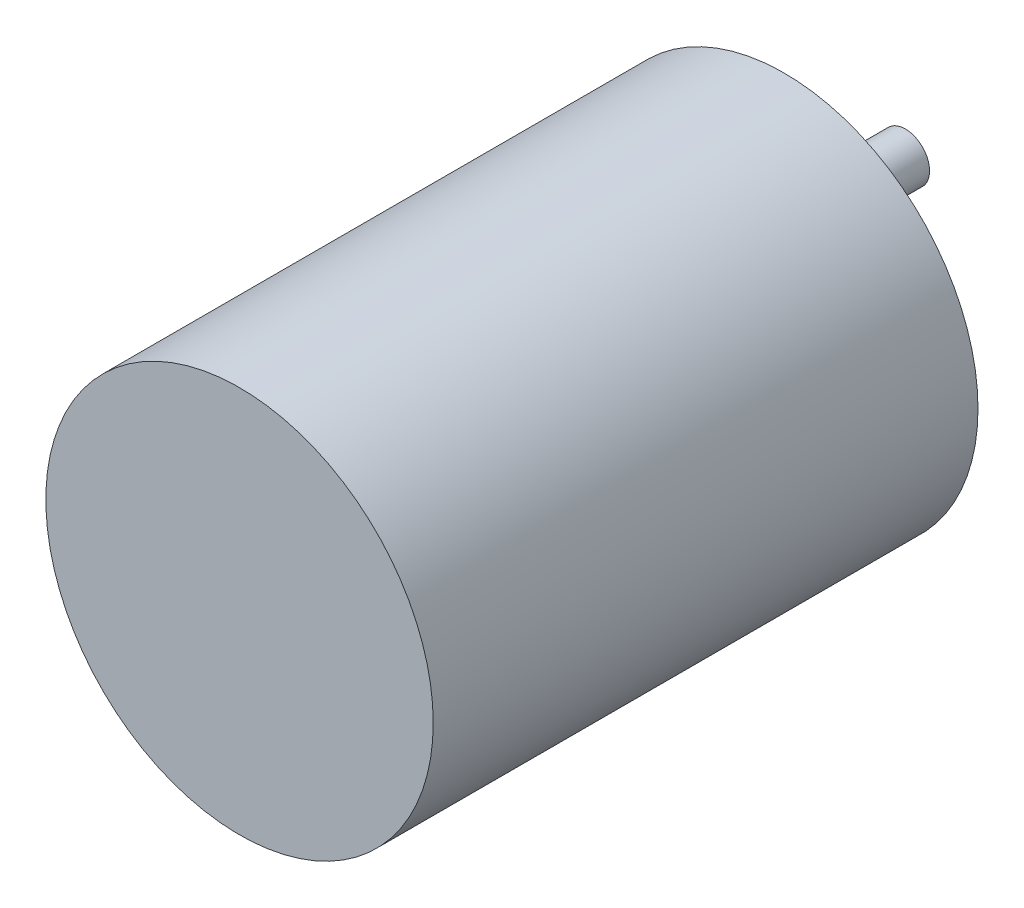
ISO-10303-21;
HEADER;
FILE_DESCRIPTION(('STEP AP214'),'2;1');
FILE_NAME('part.step','',(''),(''),'','','');
FILE_SCHEMA(('AUTOMOTIVE_DESIGN { 1 0 10303 214 1 1 1 1 }'));
ENDSEC;
DATA;
#1=APPLICATION_CONTEXT('core data for automotive mechanical design processes');
#2=APPLICATION_PROTOCOL_DEFINITION('international standard','automotive_design',2000,#1);
#3=PRODUCT_CONTEXT('',#1,'mechanical');
#4=PRODUCT('Part','Part','',(#3));
#5=PRODUCT_RELATED_PRODUCT_CATEGORY('part','',(#4));
#6=PRODUCT_DEFINITION_FORMATION('','',#4);
#7=PRODUCT_DEFINITION_CONTEXT('part definition',#1,'design');
#8=PRODUCT_DEFINITION('design','',#6,#7);
#9=PRODUCT_DEFINITION_SHAPE('','',#8);
#10=(LENGTH_UNIT() NAMED_UNIT(*) SI_UNIT(.MILLI.,.METRE.));
#11=(NAMED_UNIT(*) PLANE_ANGLE_UNIT() SI_UNIT($,.RADIAN.));
#12=(NAMED_UNIT(*) SI_UNIT($,.STERADIAN.) SOLID_ANGLE_UNIT());
#13=UNCERTAINTY_MEASURE_WITH_UNIT(LENGTH_MEASURE(1.E-05),#10,'distance_accuracy_value','');
#14=(GEOMETRIC_REPRESENTATION_CONTEXT(3) GLOBAL_UNCERTAINTY_ASSIGNED_CONTEXT((#13)) GLOBAL_UNIT_ASSIGNED_CONTEXT((#10,
#11,#12)) REPRESENTATION_CONTEXT('',''));
#15=CARTESIAN_POINT('',(0.,0.,0.));
#16=DIRECTION('',(0.,0.,1.));
#17=DIRECTION('',(1.,0.,0.));
#18=AXIS2_PLACEMENT_3D('',#15,#16,#17);
#19=CARTESIAN_POINT('',(0.,0.,0.));
#20=DIRECTION('',(0.,0.,1.));
#21=DIRECTION('',(1.,0.,0.));
#22=AXIS2_PLACEMENT_3D('',#19,#20,#21);
#23=PLANE('',#22);
#24=CARTESIAN_POINT('',(0.,1.27,0.));
#25=DIRECTION('',(0.,0.,1.));
#26=DIRECTION('',(1.,0.,0.));
#27=AXIS2_PLACEMENT_3D('',#24,#25,#26);
#28=CIRCLE('',#27,0.508);
#29=CARTESIAN_POINT('',(0.508,1.27,0.));
#30=VERTEX_POINT('',#29);
#31=EDGE_CURVE('E35',#30,#30,#28,.F.);
#32=ORIENTED_EDGE('',*,*,#31,.F.);
#33=EDGE_LOOP('',(#32));
#34=FACE_BOUND('',#33,.T.);
#35=CARTESIAN_POINT('',(0.,0.,0.));
#36=DIRECTION('',(0.,0.,1.));
#37=DIRECTION('',(1.,0.,0.));
#38=AXIS2_PLACEMENT_3D('',#35,#36,#37);
#39=CIRCLE('',#38,4.064);
#40=CARTESIAN_POINT('',(4.064,0.,0.));
#41=VERTEX_POINT('',#40);
#42=EDGE_CURVE('E43',#41,#41,#39,.T.);
#43=ORIENTED_EDGE('',*,*,#42,.F.);
#44=EDGE_LOOP('',(#43));
#45=FACE_BOUND('',#44,.T.);
#46=CARTESIAN_POINT('',(0.,-1.27,0.));
#47=DIRECTION('',(0.,0.,1.));
#48=DIRECTION('',(1.,0.,0.));
#49=AXIS2_PLACEMENT_3D('',#46,#47,#48);
#50=CIRCLE('',#49,0.508);
#51=CARTESIAN_POINT('',(0.508,-1.27,0.));
#52=VERTEX_POINT('',#51);
#53=EDGE_CURVE('E10',#52,#52,#50,.F.);
#54=ORIENTED_EDGE('',*,*,#53,.F.);
#55=EDGE_LOOP('',(#54));
#56=FACE_BOUND('',#55,.T.);
#57=ADVANCED_FACE('F28',(#34,#45,#56),#23,.F.);
#58=CARTESIAN_POINT('',(0.,0.,11.43));
#59=DIRECTION('',(0.,0.,-1.));
#60=DIRECTION('',(-1.,0.,0.));
#61=AXIS2_PLACEMENT_3D('',#58,#59,#60);
#62=CYLINDRICAL_SURFACE('',#61,4.064);
#63=CARTESIAN_POINT('',(0.,0.,11.43));
#64=DIRECTION('',(0.,0.,1.));
#65=DIRECTION('',(1.,0.,0.));
#66=AXIS2_PLACEMENT_3D('',#63,#64,#65);
#67=CIRCLE('',#66,4.064);
#68=CARTESIAN_POINT('',(4.064,0.,11.43));
#69=VERTEX_POINT('',#68);
#70=EDGE_CURVE('E39',#69,#69,#67,.T.);
#71=ORIENTED_EDGE('',*,*,#70,.F.);
#72=EDGE_LOOP('',(#71));
#73=FACE_BOUND('',#72,.T.);
#74=ORIENTED_EDGE('',*,*,#42,.T.);
#75=EDGE_LOOP('',(#74));
#76=FACE_BOUND('',#75,.T.);
#77=ADVANCED_FACE('F30',(#73,#76),#62,.T.);
#78=CARTESIAN_POINT('',(0.,0.,11.43));
#79=DIRECTION('',(0.,0.,1.));
#80=DIRECTION('',(1.,0.,0.));
#81=AXIS2_PLACEMENT_3D('',#78,#79,#80);
#82=PLANE('',#81);
#83=ORIENTED_EDGE('',*,*,#70,.T.);
#84=EDGE_LOOP('',(#83));
#85=FACE_BOUND('',#84,.T.);
#86=ADVANCED_FACE('F74',(#85),#82,.T.);
#87=CARTESIAN_POINT('',(0.,1.27,-2.54));
#88=DIRECTION('',(0.,0.,1.));
#89=DIRECTION('',(1.,0.,0.));
#90=AXIS2_PLACEMENT_3D('',#87,#88,#89);
#91=CYLINDRICAL_SURFACE('',#90,0.508);
#92=CARTESIAN_POINT('',(0.,1.27,-2.54));
#93=DIRECTION('',(0.,0.,-1.));
#94=DIRECTION('',(-1.,0.,0.));
#95=AXIS2_PLACEMENT_3D('',#92,#93,#94);
#96=CIRCLE('',#95,0.508);
#97=CARTESIAN_POINT('',(-0.508,1.27,-2.54));
#98=VERTEX_POINT('',#97);
#99=EDGE_CURVE('E47',#98,#98,#96,.T.);
#100=ORIENTED_EDGE('',*,*,#99,.F.);
#101=EDGE_LOOP('',(#100));
#102=FACE_BOUND('',#101,.T.);
#103=ORIENTED_EDGE('',*,*,#31,.T.);
#104=EDGE_LOOP('',(#103));
#105=FACE_BOUND('',#104,.T.);
#106=ADVANCED_FACE('F66',(#102,#105),#91,.T.);
#107=CARTESIAN_POINT('',(0.,1.27,-2.54));
#108=DIRECTION('',(0.,0.,-1.));
#109=DIRECTION('',(-1.,0.,0.));
#110=AXIS2_PLACEMENT_3D('',#107,#108,#109);
#111=PLANE('',#110);
#112=ORIENTED_EDGE('',*,*,#99,.T.);
#113=EDGE_LOOP('',(#112));
#114=FACE_BOUND('',#113,.T.);
#115=ADVANCED_FACE('F59',(#114),#111,.T.);
#116=CARTESIAN_POINT('',(0.,-1.27,-2.54));
#117=DIRECTION('',(0.,0.,1.));
#118=DIRECTION('',(1.,0.,0.));
#119=AXIS2_PLACEMENT_3D('',#116,#117,#118);
#120=CYLINDRICAL_SURFACE('',#119,0.508);
#121=CARTESIAN_POINT('',(0.,-1.27,-2.54));
#122=DIRECTION('',(0.,0.,-1.));
#123=DIRECTION('',(-1.,0.,0.));
#124=AXIS2_PLACEMENT_3D('',#121,#122,#123);
#125=CIRCLE('',#124,0.508);
#126=CARTESIAN_POINT('',(-0.508,-1.27,-2.54));
#127=VERTEX_POINT('',#126);
#128=EDGE_CURVE('E51',#127,#127,#125,.T.);
#129=ORIENTED_EDGE('',*,*,#128,.F.);
#130=EDGE_LOOP('',(#129));
#131=FACE_BOUND('',#130,.T.);
#132=ORIENTED_EDGE('',*,*,#53,.T.);
#133=EDGE_LOOP('',(#132));
#134=FACE_BOUND('',#133,.T.);
#135=ADVANCED_FACE('F57',(#131,#134),#120,.T.);
#136=CARTESIAN_POINT('',(0.,-1.27,-2.54));
#137=DIRECTION('',(0.,0.,-1.));
#138=DIRECTION('',(-1.,0.,0.));
#139=AXIS2_PLACEMENT_3D('',#136,#137,#138);
#140=PLANE('',#139);
#141=ORIENTED_EDGE('',*,*,#128,.T.);
#142=EDGE_LOOP('',(#141));
#143=FACE_BOUND('',#142,.T.);
#144=ADVANCED_FACE('F55',(#143),#140,.T.);
#145=CLOSED_SHELL('',(#57,#77,#86,#106,#115,#135,#144));
#146=MANIFOLD_SOLID_BREP('B2',#145);
#147=ADVANCED_BREP_SHAPE_REPRESENTATION('',(#18,#146),#14);
#148=SHAPE_DEFINITION_REPRESENTATION(#9,#147);
ENDSEC;
END-ISO-10303-21;
